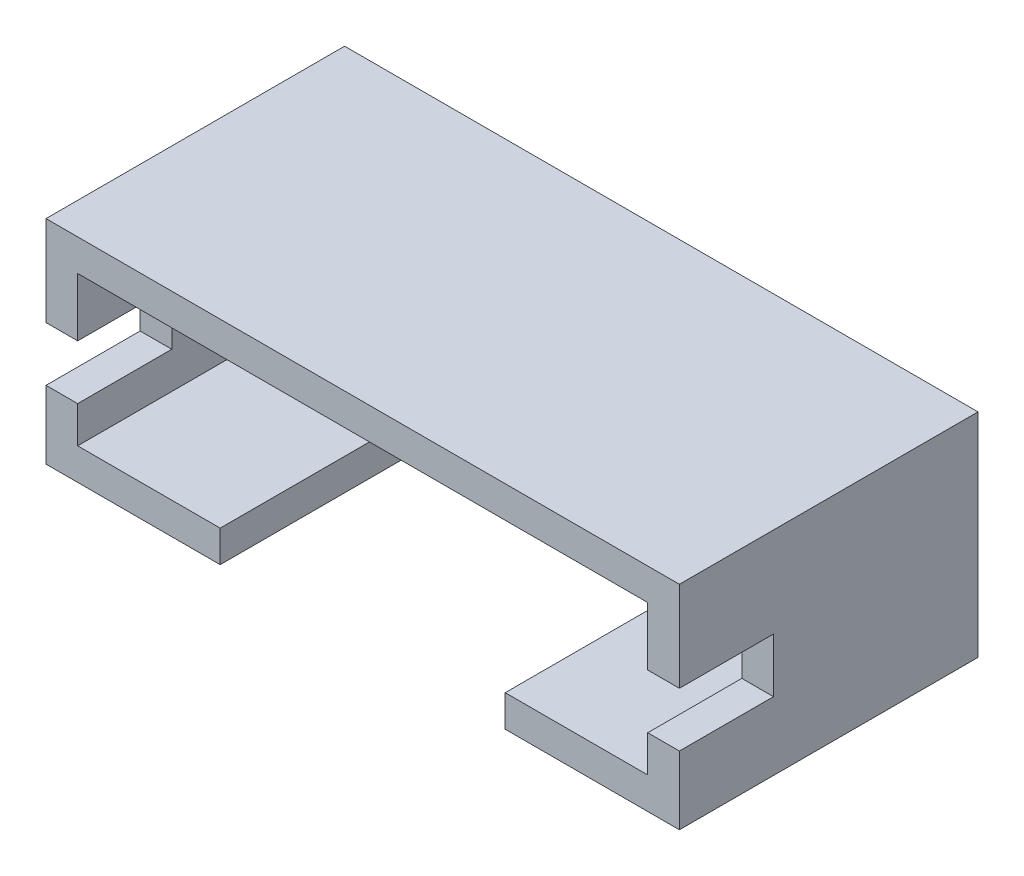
from build123d import *

# Parameters (mm, degrees)
ESQUISSE1_W             = 14
ESQUISSE1_H             = 4.7
EXTRUSION1_DEPTH        = 6.6
COQUE1_T                = -0.7
ESQUISSE2_W             = 2.07961519
ESQUISSE2_H             = 1.2
ENL_V_MAT_EXTRU_1_DEPTH = 17.175598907
ENL_V_MAT_EXTRU_2_REACH = 37.173
ESQUISSE3_W             = 6.3
ESQUISSE3_H             = 5.438100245
EXTRUSION2_DEPTH        = 3
EXTRUSION2_DEPTH_BACK   = 2
ESQUISSE4_R             = 0.302875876


with BuildPart() as part:
    # Esquisse1 → Extrusion1 (new body)
    with BuildSketch(Plane.XY):
        with Locations((27.22723449, 2.35)):
            Rectangle(ESQUISSE1_W, ESQUISSE1_H)
    extrude(amount=EXTRUSION1_DEPTH)

    # Coque1
    coque1_openings = [part.faces().sort_by_distance(p)[0] for p in [
        (27.22723449, 2.35, 6.6),
    ]]
    offset(amount=COQUE1_T, openings=coque1_openings, kind=Kind.INTERSECTION)

    # Esquisse2 → Enl_v. mat.-Extru.1 (cut, through all)
    with BuildSketch(Plane(origin=(34.22723449, 0, 0), x_dir=(0, 0, -1), z_dir=(1, 0, 0))):
        with Locations((-5.560192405, 2.108569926)):
            Rectangle(ESQUISSE2_W, ESQUISSE2_H)
    extrude(amount=-ENL_V_MAT_EXTRU_1_DEPTH, mode=Mode.SUBTRACT)

    # Esquisse3 → Enl_v. mat.-Extru.2 (cut, up to next)
    with BuildSketch(Plane.XZ, mode=Mode.PRIVATE) as enl_v_mat_extru_2_sk1:
        with Locations((27.22723449, 3.880949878)):
            Rectangle(ESQUISSE3_W, ESQUISSE3_H)
    enl_v_mat_extru_2_tool1 = extrude(enl_v_mat_extru_2_sk1.sketch, amount=-ENL_V_MAT_EXTRU_2_REACH, mode=Mode.PRIVATE) & part.part
    add(enl_v_mat_extru_2_tool1.solids().sort_by_distance((27.227234, 0, 3.88095))[0], mode=Mode.SUBTRACT)

    # Esquisse4 → Extrusion2 (add, two sides: drawn at the far end of the back side and taken through both)
    with BuildSketch(Plane.XY.offset(0.7).offset(-EXTRUSION2_DEPTH_BACK)):
        with Locations(Location((26.07196642, 2.35, 0), (0, 0, 180))):
            Circle(ESQUISSE4_R)
        with Locations(Location((28.269427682, 2.35, 0), (0, 0, 180))):
            Circle(ESQUISSE4_R)
        with Locations(Location((30.466888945, 2.35, 0), (0, 0, 180))):
            Circle(ESQUISSE4_R)
        with Locations(Location((24.269361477, 2.35, 0), (0, 0, 180))):
            Circle(ESQUISSE4_R)
        with Locations(Location((22.235158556, 2.35, 0), (0, 0, 180))):
            Circle(ESQUISSE4_R)
        with Locations(Location((32.235158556, 2.35, 0), (0, 0, 180))):
            Circle(ESQUISSE4_R)
    extrude(amount=EXTRUSION2_DEPTH + EXTRUSION2_DEPTH_BACK)


solid = part.part
